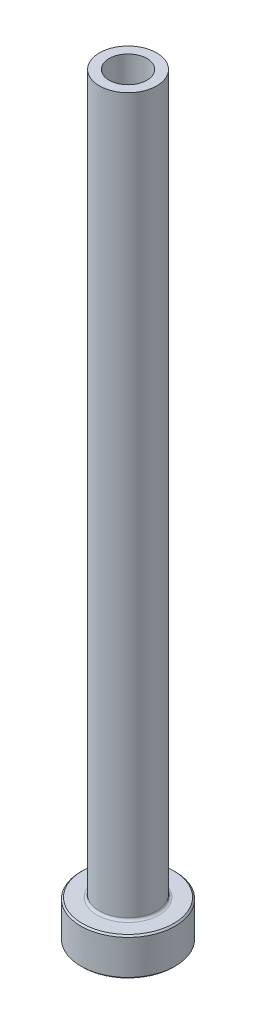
ISO-10303-21;
HEADER;
FILE_DESCRIPTION(('STEP AP214'),'2;1');
FILE_NAME('part.step','',(''),(''),'','','');
FILE_SCHEMA(('AUTOMOTIVE_DESIGN { 1 0 10303 214 1 1 1 1 }'));
ENDSEC;
DATA;
#1=APPLICATION_CONTEXT('core data for automotive mechanical design processes');
#2=APPLICATION_PROTOCOL_DEFINITION('international standard','automotive_design',2000,#1);
#3=PRODUCT_CONTEXT('',#1,'mechanical');
#4=PRODUCT('Part','Part','',(#3));
#5=PRODUCT_RELATED_PRODUCT_CATEGORY('part','',(#4));
#6=PRODUCT_DEFINITION_FORMATION('','',#4);
#7=PRODUCT_DEFINITION_CONTEXT('part definition',#1,'design');
#8=PRODUCT_DEFINITION('design','',#6,#7);
#9=PRODUCT_DEFINITION_SHAPE('','',#8);
#10=(LENGTH_UNIT() NAMED_UNIT(*) SI_UNIT(.MILLI.,.METRE.));
#11=(NAMED_UNIT(*) PLANE_ANGLE_UNIT() SI_UNIT($,.RADIAN.));
#12=(NAMED_UNIT(*) SI_UNIT($,.STERADIAN.) SOLID_ANGLE_UNIT());
#13=UNCERTAINTY_MEASURE_WITH_UNIT(LENGTH_MEASURE(1.E-05),#10,'distance_accuracy_value','');
#14=(GEOMETRIC_REPRESENTATION_CONTEXT(3) GLOBAL_UNCERTAINTY_ASSIGNED_CONTEXT((#13)) GLOBAL_UNIT_ASSIGNED_CONTEXT((#10,
#11,#12)) REPRESENTATION_CONTEXT('',''));
#15=CARTESIAN_POINT('',(0.,0.,0.));
#16=DIRECTION('',(0.,0.,1.));
#17=DIRECTION('',(1.,0.,0.));
#18=AXIS2_PLACEMENT_3D('',#15,#16,#17);
#19=CARTESIAN_POINT('',(0.,0.,0.));
#20=DIRECTION('',(0.,-1.,0.));
#21=DIRECTION('',(0.,0.,-1.));
#22=AXIS2_PLACEMENT_3D('',#19,#20,#21);
#23=PLANE('',#22);
#24=CARTESIAN_POINT('',(0.,0.,0.));
#25=DIRECTION('',(0.,-1.,0.));
#26=DIRECTION('',(0.,0.,-1.));
#27=AXIS2_PLACEMENT_3D('',#24,#25,#26);
#28=CIRCLE('',#27,7.6835);
#29=CARTESIAN_POINT('',(0.,0.,-7.6835));
#30=VERTEX_POINT('',#29);
#31=EDGE_CURVE('E44',#30,#30,#28,.T.);
#32=ORIENTED_EDGE('',*,*,#31,.T.);
#33=EDGE_LOOP('',(#32));
#34=FACE_BOUND('',#33,.T.);
#35=CARTESIAN_POINT('',(0.,0.,0.));
#36=DIRECTION('',(0.,-1.,0.));
#37=DIRECTION('',(0.,0.,-1.));
#38=AXIS2_PLACEMENT_3D('',#35,#36,#37);
#39=CIRCLE('',#38,3.76237500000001);
#40=CARTESIAN_POINT('',(0.,0.,-3.76237500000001));
#41=VERTEX_POINT('',#40);
#42=EDGE_CURVE('E58',#41,#41,#39,.T.);
#43=ORIENTED_EDGE('',*,*,#42,.F.);
#44=EDGE_LOOP('',(#43));
#45=FACE_BOUND('',#44,.T.);
#46=ADVANCED_FACE('F29',(#34,#45),#23,.T.);
#47=CARTESIAN_POINT('',(0.,0.,0.));
#48=DIRECTION('',(0.,-1.,0.));
#49=DIRECTION('',(0.,0.,-1.));
#50=AXIS2_PLACEMENT_3D('',#47,#48,#49);
#51=CYLINDRICAL_SURFACE('',#50,7.9375);
#52=CARTESIAN_POINT('',(0.,0.254000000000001,0.));
#53=DIRECTION('',(0.,-1.,0.));
#54=DIRECTION('',(0.,0.,-1.));
#55=AXIS2_PLACEMENT_3D('',#52,#53,#54);
#56=CIRCLE('',#55,7.9375);
#57=CARTESIAN_POINT('',(0.,0.254000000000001,-7.9375));
#58=VERTEX_POINT('',#57);
#59=EDGE_CURVE('E36',#58,#58,#56,.F.);
#60=ORIENTED_EDGE('',*,*,#59,.T.);
#61=EDGE_LOOP('',(#60));
#62=FACE_BOUND('',#61,.T.);
#63=CARTESIAN_POINT('',(0.,6.09600000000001,0.));
#64=DIRECTION('',(0.,1.,0.));
#65=DIRECTION('',(0.,0.,1.));
#66=AXIS2_PLACEMENT_3D('',#63,#64,#65);
#67=CIRCLE('',#66,7.9375);
#68=CARTESIAN_POINT('',(0.,6.09600000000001,7.9375));
#69=VERTEX_POINT('',#68);
#70=EDGE_CURVE('E40',#69,#69,#67,.F.);
#71=ORIENTED_EDGE('',*,*,#70,.T.);
#72=EDGE_LOOP('',(#71));
#73=FACE_BOUND('',#72,.T.);
#74=ADVANCED_FACE('F103',(#62,#73),#51,.T.);
#75=CARTESIAN_POINT('',(7.9375,6.35,0.));
#76=DIRECTION('',(0.,1.,0.));
#77=DIRECTION('',(0.,0.,1.));
#78=AXIS2_PLACEMENT_3D('',#75,#76,#77);
#79=PLANE('',#78);
#80=CARTESIAN_POINT('',(0.,6.35,0.));
#81=DIRECTION('',(0.,1.,0.));
#82=DIRECTION('',(0.,0.,1.));
#83=AXIS2_PLACEMENT_3D('',#80,#81,#82);
#84=CIRCLE('',#83,7.68350000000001);
#85=CARTESIAN_POINT('',(0.,6.35,7.68350000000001));
#86=VERTEX_POINT('',#85);
#87=EDGE_CURVE('E10',#86,#86,#84,.T.);
#88=ORIENTED_EDGE('',*,*,#87,.T.);
#89=EDGE_LOOP('',(#88));
#90=FACE_BOUND('',#89,.T.);
#91=CARTESIAN_POINT('',(0.,6.35,0.));
#92=DIRECTION('',(0.,-1.,0.));
#93=DIRECTION('',(0.,0.,-1.));
#94=AXIS2_PLACEMENT_3D('',#91,#92,#93);
#95=CIRCLE('',#94,5.216525);
#96=CARTESIAN_POINT('',(0.,6.35,-5.216525));
#97=VERTEX_POINT('',#96);
#98=EDGE_CURVE('E49',#97,#97,#95,.T.);
#99=ORIENTED_EDGE('',*,*,#98,.T.);
#100=EDGE_LOOP('',(#99));
#101=FACE_BOUND('',#100,.T.);
#102=ADVANCED_FACE('F109',(#90,#101),#79,.T.);
#103=CARTESIAN_POINT('',(0.,6.746875,0.));
#104=DIRECTION('',(0.,-1.,0.));
#105=DIRECTION('',(0.,0.,-1.));
#106=AXIS2_PLACEMENT_3D('',#103,#104,#105);
#107=TOROIDAL_SURFACE('',#106,5.216525,0.396875);
#108=CARTESIAN_POINT('',(0.,6.746875,0.));
#109=DIRECTION('',(0.,-1.,0.));
#110=DIRECTION('',(0.,0.,-1.));
#111=AXIS2_PLACEMENT_3D('',#108,#109,#110);
#112=CIRCLE('',#111,4.81965);
#113=CARTESIAN_POINT('',(0.,6.746875,-4.81965));
#114=VERTEX_POINT('',#113);
#115=EDGE_CURVE('E52',#114,#114,#112,.T.);
#116=ORIENTED_EDGE('',*,*,#115,.T.);
#117=EDGE_LOOP('',(#116));
#118=FACE_BOUND('',#117,.T.);
#119=ORIENTED_EDGE('',*,*,#98,.F.);
#120=EDGE_LOOP('',(#119));
#121=FACE_BOUND('',#120,.T.);
#122=ADVANCED_FACE('F139',(#118,#121),#107,.F.);
#123=CARTESIAN_POINT('',(0.,0.,0.));
#124=DIRECTION('',(0.,-1.,0.));
#125=DIRECTION('',(0.,0.,-1.));
#126=AXIS2_PLACEMENT_3D('',#123,#124,#125);
#127=CYLINDRICAL_SURFACE('',#126,4.81965);
#128=CARTESIAN_POINT('',(0.,127.,0.));
#129=DIRECTION('',(0.,-1.,0.));
#130=DIRECTION('',(0.,0.,-1.));
#131=AXIS2_PLACEMENT_3D('',#128,#129,#130);
#132=CIRCLE('',#131,4.81965);
#133=CARTESIAN_POINT('',(0.,127.,-4.81965));
#134=VERTEX_POINT('',#133);
#135=EDGE_CURVE('E55',#134,#134,#132,.T.);
#136=ORIENTED_EDGE('',*,*,#135,.T.);
#137=EDGE_LOOP('',(#136));
#138=FACE_BOUND('',#137,.T.);
#139=ORIENTED_EDGE('',*,*,#115,.F.);
#140=EDGE_LOOP('',(#139));
#141=FACE_BOUND('',#140,.T.);
#142=ADVANCED_FACE('F182',(#138,#141),#127,.T.);
#143=CARTESIAN_POINT('',(4.81965,127.,0.));
#144=DIRECTION('',(0.,1.,0.));
#145=DIRECTION('',(0.,0.,1.));
#146=AXIS2_PLACEMENT_3D('',#143,#144,#145);
#147=PLANE('',#146);
#148=CARTESIAN_POINT('',(0.,127.,0.));
#149=DIRECTION('',(0.,-1.,0.));
#150=DIRECTION('',(0.,0.,-1.));
#151=AXIS2_PLACEMENT_3D('',#148,#149,#150);
#152=CIRCLE('',#151,3.175);
#153=CARTESIAN_POINT('',(0.,127.,-3.175));
#154=VERTEX_POINT('',#153);
#155=EDGE_CURVE('E70',#154,#154,#152,.T.);
#156=ORIENTED_EDGE('',*,*,#155,.T.);
#157=EDGE_LOOP('',(#156));
#158=FACE_BOUND('',#157,.T.);
#159=ORIENTED_EDGE('',*,*,#135,.F.);
#160=EDGE_LOOP('',(#159));
#161=FACE_BOUND('',#160,.T.);
#162=ADVANCED_FACE('F74',(#158,#161),#147,.T.);
#163=CARTESIAN_POINT('',(0.,0.,0.));
#164=DIRECTION('',(0.,-1.,0.));
#165=DIRECTION('',(0.,0.,-1.));
#166=AXIS2_PLACEMENT_3D('',#163,#164,#165);
#167=CONICAL_SURFACE('',#166,3.76237500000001,0.785398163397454);
#168=CARTESIAN_POINT('',(0.,0.396875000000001,0.));
#169=DIRECTION('',(0.,-1.,0.));
#170=DIRECTION('',(0.,0.,-1.));
#171=AXIS2_PLACEMENT_3D('',#168,#169,#170);
#172=CIRCLE('',#171,3.3655);
#173=CARTESIAN_POINT('',(0.,0.396875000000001,-3.3655));
#174=VERTEX_POINT('',#173);
#175=EDGE_CURVE('E61',#174,#174,#172,.T.);
#176=ORIENTED_EDGE('',*,*,#175,.F.);
#177=EDGE_LOOP('',(#176));
#178=FACE_BOUND('',#177,.T.);
#179=ORIENTED_EDGE('',*,*,#42,.T.);
#180=EDGE_LOOP('',(#179));
#181=FACE_BOUND('',#180,.T.);
#182=ADVANCED_FACE('F93',(#178,#181),#167,.F.);
#183=CARTESIAN_POINT('',(0.,0.,0.));
#184=DIRECTION('',(0.,-1.,0.));
#185=DIRECTION('',(0.,0.,-1.));
#186=AXIS2_PLACEMENT_3D('',#183,#184,#185);
#187=CYLINDRICAL_SURFACE('',#186,3.3655);
#188=CARTESIAN_POINT('',(0.,52.5145,0.));
#189=DIRECTION('',(0.,-1.,0.));
#190=DIRECTION('',(0.,0.,-1.));
#191=AXIS2_PLACEMENT_3D('',#188,#189,#190);
#192=CIRCLE('',#191,3.3655);
#193=CARTESIAN_POINT('',(0.,52.5145,-3.3655));
#194=VERTEX_POINT('',#193);
#195=EDGE_CURVE('E64',#194,#194,#192,.T.);
#196=ORIENTED_EDGE('',*,*,#195,.F.);
#197=EDGE_LOOP('',(#196));
#198=FACE_BOUND('',#197,.T.);
#199=ORIENTED_EDGE('',*,*,#175,.T.);
#200=EDGE_LOOP('',(#199));
#201=FACE_BOUND('',#200,.T.);
#202=ADVANCED_FACE('F87',(#198,#201),#187,.F.);
#203=CARTESIAN_POINT('',(0.,52.5145,0.));
#204=DIRECTION('',(0.,-1.,0.));
#205=DIRECTION('',(0.,0.,-1.));
#206=AXIS2_PLACEMENT_3D('',#203,#204,#205);
#207=CONICAL_SURFACE('',#206,3.3655,0.0133325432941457);
#208=CARTESIAN_POINT('',(0.,66.802,0.));
#209=DIRECTION('',(0.,-1.,0.));
#210=DIRECTION('',(0.,0.,-1.));
#211=AXIS2_PLACEMENT_3D('',#208,#209,#210);
#212=CIRCLE('',#211,3.175);
#213=CARTESIAN_POINT('',(0.,66.802,-3.175));
#214=VERTEX_POINT('',#213);
#215=EDGE_CURVE('E67',#214,#214,#212,.T.);
#216=ORIENTED_EDGE('',*,*,#215,.F.);
#217=EDGE_LOOP('',(#216));
#218=FACE_BOUND('',#217,.T.);
#219=ORIENTED_EDGE('',*,*,#195,.T.);
#220=EDGE_LOOP('',(#219));
#221=FACE_BOUND('',#220,.T.);
#222=ADVANCED_FACE('F81',(#218,#221),#207,.F.);
#223=CARTESIAN_POINT('',(0.,0.,0.));
#224=DIRECTION('',(0.,-1.,0.));
#225=DIRECTION('',(0.,0.,-1.));
#226=AXIS2_PLACEMENT_3D('',#223,#224,#225);
#227=CYLINDRICAL_SURFACE('',#226,3.175);
#228=ORIENTED_EDGE('',*,*,#155,.F.);
#229=EDGE_LOOP('',(#228));
#230=FACE_BOUND('',#229,.T.);
#231=ORIENTED_EDGE('',*,*,#215,.T.);
#232=EDGE_LOOP('',(#231));
#233=FACE_BOUND('',#232,.T.);
#234=ADVANCED_FACE('F77',(#230,#233),#227,.F.);
#235=CARTESIAN_POINT('',(0.,0.,0.));
#236=DIRECTION('',(0.,1.,0.));
#237=DIRECTION('',(0.,0.,1.));
#238=AXIS2_PLACEMENT_3D('',#235,#236,#237);
#239=CONICAL_SURFACE('',#238,7.6835,0.785398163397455);
#240=ORIENTED_EDGE('',*,*,#59,.F.);
#241=EDGE_LOOP('',(#240));
#242=FACE_BOUND('',#241,.T.);
#243=ORIENTED_EDGE('',*,*,#31,.F.);
#244=EDGE_LOOP('',(#243));
#245=FACE_BOUND('',#244,.T.);
#246=ADVANCED_FACE('F80',(#242,#245),#239,.T.);
#247=CARTESIAN_POINT('',(0.,6.09600000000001,0.));
#248=DIRECTION('',(0.,-1.,0.));
#249=DIRECTION('',(0.,0.,-1.));
#250=AXIS2_PLACEMENT_3D('',#247,#248,#249);
#251=CONICAL_SURFACE('',#250,7.9375,0.785398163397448);
#252=ORIENTED_EDGE('',*,*,#87,.F.);
#253=EDGE_LOOP('',(#252));
#254=FACE_BOUND('',#253,.T.);
#255=ORIENTED_EDGE('',*,*,#70,.F.);
#256=EDGE_LOOP('',(#255));
#257=FACE_BOUND('',#256,.T.);
#258=ADVANCED_FACE('F31',(#254,#257),#251,.T.);
#259=CLOSED_SHELL('',(#46,#74,#102,#122,#142,#162,#182,#202,#222,#234,#246,#258));
#260=MANIFOLD_SOLID_BREP('B2',#259);
#261=ADVANCED_BREP_SHAPE_REPRESENTATION('',(#18,#260),#14);
#262=SHAPE_DEFINITION_REPRESENTATION(#9,#261);
ENDSEC;
END-ISO-10303-21;
